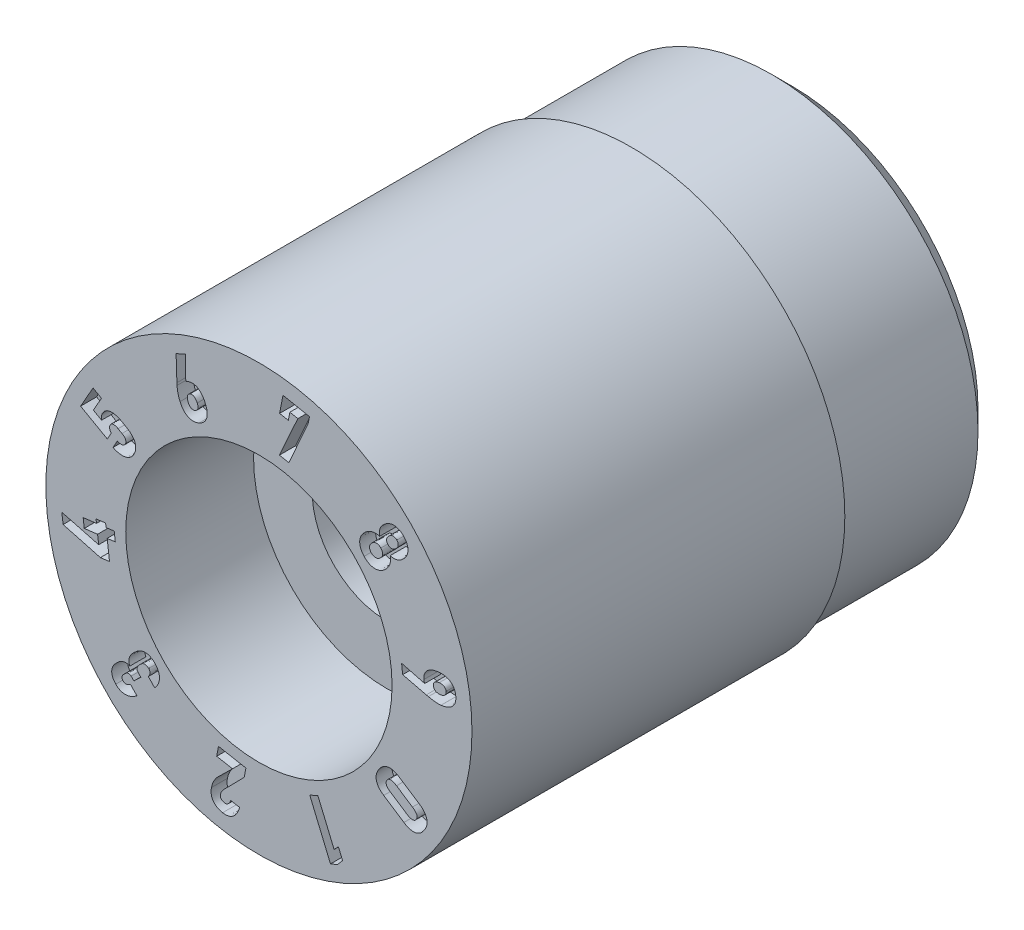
from build123d import *

# Parameters (mm, degrees)
SKETCH5_W          = 1.5
SKETCH5_H          = 1
CUT_EXTRUDE1_DEPTH = 0.15


with BuildPart() as part:
    # Sketch1 → Revolve1 (revolve)
    with BuildSketch(Plane(origin=(0, 0, 0), x_dir=(0, 0, -1), z_dir=(1, 0, 0)), mode=Mode.PRIVATE) as revolve1_sk:
        Polygon((0, 2), (0, 1.25), (1.2, 1.25), (1.2, 0.7), (5, 0.7), (5, 1.75), (4.75, 2), align=None)
    revolve(revolve1_sk.sketch.rotate(Axis((0, 0, 3.797909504), (0, 0, -1)), 90), axis=Axis((0, 0, 3.797909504), (0, 0, -1)))

    # Sketch5 → Cut-Revolve1 (revolve, cut)
    with BuildSketch(Plane(origin=(0, 0, 0), x_dir=(0, 0, -1), z_dir=(1, 0, 0)), mode=Mode.PRIVATE) as cut_revolve1_sk:
        with Locations((4.25, 2.435)):
            Rectangle(SKETCH5_W, SKETCH5_H)
    revolve(cut_revolve1_sk.sketch.rotate(Axis((0, 0, 0), (0, 0, -1)), 90), axis=Axis((0, 0, 0), (0, 0, -1)), mode=Mode.SUBTRACT)

    # Sketch7 → Cut-Extrude1 (cut)
    # profile 1 of 10: a face of its own
    with BuildSketch(Plane.XY):
        Polygon((0.474684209, 1.798838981), (0.462762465, 1.73749804), (0.281796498, 1.327063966), (0.192841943, 1.344386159), (0.365554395, 1.7276142), (0.290661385, 1.742185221), (0.276294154, 1.668209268), (0.194268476, 1.684206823), (0.2259579, 1.847239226), align=None)
    # profile 2 of 10: a face of its own
    with BuildSketch(Plane.XY):
        with BuildLine():
            Line((-0.740461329, 1.313243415), (-0.740359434, 1.312937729))
            add(Edge.make_bspline(
                [(-0.560208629, 1.229485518), (-0.571763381, 1.2241647), (-0.589587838, 1.218286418), (-0.61382565, 1.215481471), (-0.631073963, 1.216215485), (-0.647777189, 1.219448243), (-0.663698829, 1.225474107), (-0.678878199, 1.23399263), (-0.693304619, 1.244970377), (-0.706755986, 1.258514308), (-0.723784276, 1.280582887), (-0.734243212, 1.299464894), (-0.740359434, 1.312937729)],
                knots=[0, 0, 0, 0, 0.169424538, 0.247700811, 0.323760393, 0.398455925, 0.473317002, 0.549457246, 0.629523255, 0.713964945, 0.802912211, 1, 1, 1, 1], degree=3))
            add(Edge.make_bspline(
                [(-0.505287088, 1.421965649), (-0.49915535, 1.408359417), (-0.491382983, 1.387951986), (-0.48612773, 1.360295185), (-0.484601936, 1.341111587), (-0.485567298, 1.3228304), (-0.48902194, 1.305609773), (-0.494994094, 1.28950997), (-0.503423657, 1.274617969), (-0.514243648, 1.261061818), (-0.53226974, 1.24442119), (-0.548559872, 1.234827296), (-0.560208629, 1.229485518)],
                knots=[0, 0, 0, 0, 0.197487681, 0.286549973, 0.37114358, 0.451142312, 0.527616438, 0.602298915, 0.677047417, 0.752732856, 0.830522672, 1, 1, 1, 1], degree=3))
            Line((-0.505287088, 1.421965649), (-0.505388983, 1.422271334))
            add(Edge.make_bspline(
                [(-0.67219151, 1.509799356), (-0.661856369, 1.514610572), (-0.645732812, 1.519658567), (-0.623821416, 1.521453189), (-0.608101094, 1.520077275), (-0.592822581, 1.516294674), (-0.578054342, 1.509983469), (-0.563993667, 1.501063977), (-0.550658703, 1.489703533), (-0.537836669, 1.476226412), (-0.521601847, 1.454172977), (-0.511388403, 1.435563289), (-0.505388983, 1.422271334)],
                knots=[0, 0, 0, 0, 0.160458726, 0.235287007, 0.308247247, 0.381671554, 0.456024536, 0.533385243, 0.615194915, 0.702138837, 0.79472917, 1, 1, 1, 1], degree=3))
            add(Edge.make_bspline(
                [(-0.686243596, 1.501398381), (-0.681884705, 1.504702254), (-0.677169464, 1.507525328), (-0.67219151, 1.509799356)],
                knots=[0.764686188, 0.764686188, 0.764686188, 0.764686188, 1, 1, 1, 1], degree=3))
            Line((-0.686243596, 1.501398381), (-0.691347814, 1.723473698))
            Line((-0.691347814, 1.723473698), (-0.777143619, 1.684345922))
            Line((-0.777143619, 1.684345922), (-0.769909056, 1.451719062))
            add(Edge.make_bspline(
                [(-0.768584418, 1.430015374), (-0.768926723, 1.433644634), (-0.769680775, 1.440864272), (-0.769708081, 1.448122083), (-0.769909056, 1.451719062)],
                knots=[0, 0, 0, 0, 0.503063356, 1, 1, 1, 1], degree=3))
            add(Edge.make_bspline(
                [(-0.740461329, 1.313243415), (-0.744328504, 1.321719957), (-0.749611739, 1.334915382), (-0.755144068, 1.353319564), (-0.763192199, 1.383170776), (-0.766638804, 1.409125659), (-0.768584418, 1.430015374)],
                knots=[0, 0, 0, 0, 0.231657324, 0.352643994, 0.477573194, 1, 1, 1, 1], degree=3))
        make_face()
        with BuildLine():
            Line((-0.578957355, 1.382328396), (-0.578753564, 1.38202271))
            add(Edge.make_bspline(
                [(-0.597807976, 1.311918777), (-0.591682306, 1.31465331), (-0.583365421, 1.320235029), (-0.575624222, 1.330669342), (-0.572300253, 1.339484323), (-0.570731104, 1.349121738), (-0.571609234, 1.363829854), (-0.575451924, 1.374774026), (-0.578753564, 1.38202271)],
                knots=[0, 0, 0, 0, 0.244452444, 0.355993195, 0.467581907, 0.584057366, 0.709091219, 1, 1, 1, 1], degree=3))
            add(Edge.make_bspline(
                [(-0.662613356, 1.343506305), (-0.659337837, 1.336279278), (-0.653576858, 1.326212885), (-0.64305087, 1.316006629), (-0.6348762, 1.310712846), (-0.626053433, 1.30769299), (-0.613325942, 1.306594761), (-0.603773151, 1.309082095), (-0.597807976, 1.311918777)],
                knots=[0, 0, 0, 0, 0.292476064, 0.418585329, 0.535161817, 0.647146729, 0.757326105, 1, 1, 1, 1], degree=3))
            Line((-0.662613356, 1.343506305), (-0.662715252, 1.343811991))
            add(Edge.make_bspline(
                [(-0.64773665, 1.421456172), (-0.653766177, 1.418775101), (-0.662202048, 1.41296223), (-0.668932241, 1.401502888), (-0.671900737, 1.391812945), (-0.672759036, 1.380982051), (-0.67080472, 1.364454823), (-0.666539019, 1.352058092), (-0.662715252, 1.343811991)],
                knots=[0, 0, 0, 0, 0.223938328, 0.330652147, 0.442080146, 0.562622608, 0.693739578, 1, 1, 1, 1], degree=3))
            add(Edge.make_bspline(
                [(-0.578957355, 1.382328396), (-0.58271389, 1.390669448), (-0.589222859, 1.402101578), (-0.600477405, 1.414393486), (-0.609209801, 1.420720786), (-0.618451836, 1.424792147), (-0.631671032, 1.426761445), (-0.641654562, 1.424428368), (-0.64773665, 1.421456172)],
                knots=[0, 0, 0, 0, 0.307386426, 0.437241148, 0.556520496, 0.666849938, 0.77294532, 1, 1, 1, 1], degree=3))
        make_face(mode=Mode.SUBTRACT)
    # profile 3 of 10: a face of its own
    with BuildSketch(Plane.XY):
        with BuildLine():
            Line((-1.369282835, 0.625845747), (-1.368977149, 0.625641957))
            add(Edge.make_bspline(
                [(-1.175070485, 0.664565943), (-1.180651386, 0.654688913), (-1.19082486, 0.640990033), (-1.207871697, 0.626351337), (-1.221856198, 0.617309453), (-1.237192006, 0.610462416), (-1.25361801, 0.60573298), (-1.271143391, 0.603357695), (-1.289585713, 0.603044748), (-1.308805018, 0.605149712), (-1.335932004, 0.611266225), (-1.355852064, 0.619229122), (-1.368977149, 0.625641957)],
                knots=[0, 0, 0, 0, 0.154778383, 0.229982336, 0.305397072, 0.381063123, 0.458169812, 0.537687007, 0.621529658, 0.709094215, 0.800674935, 1, 1, 1, 1], degree=3))
            add(Edge.make_bspline(
                [(-1.244461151, 0.85347974), (-1.231374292, 0.846040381), (-1.213000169, 0.833936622), (-1.19225839, 0.814580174), (-1.179747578, 0.7997833), (-1.169715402, 0.784340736), (-1.162422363, 0.768289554), (-1.157557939, 0.751766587), (-1.155681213, 0.73471278), (-1.156413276, 0.717331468), (-1.161134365, 0.693159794), (-1.16877107, 0.675772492), (-1.175070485, 0.664565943)],
                knots=[0, 0, 0, 0, 0.19806082, 0.28743423, 0.372024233, 0.452139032, 0.528649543, 0.602965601, 0.677550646, 0.753055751, 0.830797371, 1, 1, 1, 1], degree=3))
            Line((-1.244461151, 0.85347974), (-1.280939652, 0.874164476))
            add(Edge.make_bspline(
                [(-1.467713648, 0.854906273), (-1.46255547, 0.864339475), (-1.452857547, 0.877018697), (-1.436688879, 0.890223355), (-1.423401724, 0.897602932), (-1.408873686, 0.902756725), (-1.393205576, 0.905449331), (-1.376546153, 0.905897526), (-1.358914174, 0.904122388), (-1.340446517, 0.899891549), (-1.313665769, 0.891278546), (-1.294078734, 0.8814588), (-1.280939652, 0.874164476)],
                knots=[0, 0, 0, 0, 0.15216642, 0.223346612, 0.294447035, 0.366447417, 0.440746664, 0.518750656, 0.601933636, 0.691146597, 0.786728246, 1, 1, 1, 1], degree=3))
            add(Edge.make_bspline(
                [(-1.476782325, 0.793463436), (-1.478340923, 0.798034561), (-1.479463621, 0.805390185), (-1.479473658, 0.815599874), (-1.47852254, 0.823821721), (-1.476826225, 0.832101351), (-1.473684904, 0.842700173), (-1.470490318, 0.850252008), (-1.467713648, 0.854906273)],
                knots=[0, 0, 0, 0, 0.226423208, 0.347978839, 0.479918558, 0.615426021, 0.745491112, 1, 1, 1, 1], degree=3))
            Line((-1.476782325, 0.793463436), (-1.55371324, 0.836972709))
            Line((-1.55371324, 0.836972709), (-1.477903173, 0.970964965))
            Line((-1.477903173, 0.970964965), (-1.556871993, 1.015595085))
            Line((-1.556871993, 1.015595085), (-1.673643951, 0.809155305))
            Line((-1.673643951, 0.809155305), (-1.423389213, 0.6676228))
            Line((-1.423389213, 0.6676228), (-1.385178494, 0.735281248))
            add(Edge.make_bspline(
                [(-1.395673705, 0.796316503), (-1.398355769, 0.791427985), (-1.401610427, 0.783629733), (-1.402501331, 0.772678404), (-1.401921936, 0.764646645), (-1.399856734, 0.756738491), (-1.395020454, 0.746314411), (-1.389424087, 0.739457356), (-1.385178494, 0.735281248)],
                knots=[0, 0, 0, 0, 0.250775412, 0.369741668, 0.488581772, 0.609434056, 0.733145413, 1, 1, 1, 1], degree=3))
            add(Edge.make_bspline(
                [(-1.321901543, 0.801716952), (-1.329528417, 0.806090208), (-1.340943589, 0.811440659), (-1.356496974, 0.814852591), (-1.366639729, 0.815110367), (-1.375844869, 0.813463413), (-1.386683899, 0.808313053), (-1.392870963, 0.801603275), (-1.395673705, 0.796316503)],
                knots=[0, 0, 0, 0, 0.317819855, 0.450521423, 0.571898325, 0.681761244, 0.784843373, 1, 1, 1, 1], degree=3))
            Line((-1.321901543, 0.801716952), (-1.285423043, 0.781032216))
            add(Edge.make_bspline(
                [(-1.254039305, 0.710724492), (-1.250829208, 0.716462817), (-1.247335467, 0.72597478), (-1.248302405, 0.73902214), (-1.251235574, 0.748413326), (-1.256616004, 0.75741654), (-1.267121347, 0.769636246), (-1.277848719, 0.776616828), (-1.285423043, 0.781032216)],
                knots=[0, 0, 0, 0, 0.229073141, 0.335997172, 0.446505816, 0.565755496, 0.695468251, 1, 1, 1, 1], degree=3))
            add(Edge.make_bspline(
                [(-1.328015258, 0.698089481), (-1.32043139, 0.694668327), (-1.309035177, 0.690615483), (-1.293731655, 0.688924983), (-1.283528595, 0.689577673), (-1.274244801, 0.692102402), (-1.263169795, 0.697968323), (-1.257062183, 0.705316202), (-1.254039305, 0.710724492)],
                knots=[0, 0, 0, 0, 0.300684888, 0.43118925, 0.55272704, 0.667113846, 0.7755996, 1, 1, 1, 1], degree=3))
            Line((-1.328015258, 0.698089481), (-1.328320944, 0.698293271))
            Line((-1.328320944, 0.698293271), (-1.369282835, 0.625845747))
        make_face()
    # profile 4 of 10: a face of its own
    with BuildSketch(Plane.XY):
        Polygon((-1.524583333, -0.069292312), (-1.528883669, -0.034854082), (-1.439012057, -0.023645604), (-1.434712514, -0.058113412), (-1.358311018, -0.048609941), (-1.348019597, -0.131552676), (-1.424367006, -0.141049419), (-1.402227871, -0.318530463), (-1.488023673, -0.329229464), (-1.838135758, -0.235180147), (-1.849751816, -0.141436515), (-1.504225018, -0.23232708), (-1.514227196, -0.152226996), (-1.639643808, -0.167827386), (-1.649935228, -0.084884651), align=None)
    # profile 5 of 10: a face of its own
    with BuildSketch(Plane.XY):
        with BuildLine():
            add(Edge.make_bspline(
                [(-1.163926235, -0.935231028), (-1.154002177, -0.92604651), (-1.138799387, -0.913306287), (-1.116326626, -0.901097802), (-1.100003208, -0.89456321), (-1.083558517, -0.890612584), (-1.067203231, -0.889287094), (-1.050927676, -0.890368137), (-1.034863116, -0.894238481), (-1.019091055, -0.900550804), (-0.997846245, -0.912378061), (-0.983926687, -0.925034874), (-0.975012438, -0.93411018)],
                knots=[0, 0, 0, 0, 0.189438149, 0.274812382, 0.356421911, 0.434469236, 0.510181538, 0.584875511, 0.661428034, 0.740040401, 0.821631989, 1, 1, 1, 1], degree=3))
            add(Edge.make_bspline(
                [(-0.975012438, -0.93411018), (-0.966406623, -0.943428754), (-0.954558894, -0.958163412), (-0.943429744, -0.980227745), (-0.937464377, -0.996966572), (-0.933894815, -1.014103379), (-0.932542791, -1.031463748), (-0.934145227, -1.048976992), (-0.937853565, -1.066550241), (-0.944253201, -1.083964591), (-0.956535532, -1.107219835), (-0.969109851, -1.123082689), (-0.978680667, -1.132907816)],
                knots=[0, 0, 0, 0, 0.171379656, 0.252459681, 0.332099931, 0.410217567, 0.487784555, 0.565878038, 0.646425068, 0.729269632, 0.815073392, 1, 1, 1, 1], degree=3))
            Line((-0.978680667, -1.132907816), (-1.037881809, -1.070751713))
            add(Edge.make_bspline(
                [(-1.037881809, -1.070751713), (-1.031883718, -1.063757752), (-1.026065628, -1.05374623), (-1.022886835, -1.040898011), (-1.022254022, -1.03503418), (-1.022476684, -1.029311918), (-1.023389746, -1.023760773), (-1.025045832, -1.018371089), (-1.02835074, -1.011303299), (-1.032113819, -1.006637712), (-1.034824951, -1.003704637)],
                knots=[0, 0, 0, 0, 0.373226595, 0.45514242, 0.53383078, 0.610762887, 0.685922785, 0.760617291, 0.838001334, 1, 1, 1, 1], degree=3))
            add(Edge.make_bspline(
                [(-1.034824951, -1.003704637), (-1.039728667, -0.998628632), (-1.048012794, -0.991841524), (-1.061155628, -0.987865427), (-1.071007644, -0.987124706), (-1.081039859, -0.988708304), (-1.09502546, -0.994263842), (-1.104405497, -1.001428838), (-1.110227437, -1.00706718)],
                knots=[0, 0, 0, 0, 0.249603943, 0.362893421, 0.476239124, 0.593030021, 0.715449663, 1, 1, 1, 1], degree=3))
            Line((-1.110227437, -1.00706718), (-1.118684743, -1.015116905))
            add(Edge.make_bspline(
                [(-1.118684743, -1.015116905), (-1.124631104, -1.02106653), (-1.133115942, -1.029896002), (-1.14037664, -1.043407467), (-1.143661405, -1.052685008), (-1.144520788, -1.061746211), (-1.142744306, -1.073446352), (-1.137788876, -1.081058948), (-1.13376524, -1.085322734)],
                knots=[0, 0, 0, 0, 0.313958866, 0.446943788, 0.566426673, 0.676461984, 0.781027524, 1, 1, 1, 1], degree=3))
            Line((-1.13376524, -1.085322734), (-1.108087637, -1.112324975))
            Line((-1.108087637, -1.112324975), (-1.173708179, -1.174786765))
            Line((-1.173708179, -1.174786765), (-1.199385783, -1.147784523))
            add(Edge.make_bspline(
                [(-1.199385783, -1.147784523), (-1.202694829, -1.144289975), (-1.208883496, -1.139967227), (-1.218655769, -1.13852041), (-1.226337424, -1.139200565), (-1.23443772, -1.141635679), (-1.246083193, -1.147740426), (-1.254196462, -1.154258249), (-1.259402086, -1.159298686)],
                knots=[0, 0, 0, 0, 0.21247136, 0.314900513, 0.426780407, 0.547702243, 0.682698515, 1, 1, 1, 1], degree=3))
            Line((-1.259402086, -1.159298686), (-1.265617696, -1.165208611))
            add(Edge.make_bspline(
                [(-1.265617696, -1.165208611), (-1.270582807, -1.169855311), (-1.277088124, -1.177279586), (-1.282707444, -1.188453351), (-1.284949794, -1.196381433), (-1.285286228, -1.204131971), (-1.283271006, -1.214294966), (-1.278910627, -1.220975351), (-1.27519585, -1.224715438)],
                knots=[0, 0, 0, 0, 0.30029639, 0.428754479, 0.548155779, 0.660447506, 0.767243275, 1, 1, 1, 1], degree=3))
            add(Edge.make_bspline(
                [(-1.27519585, -1.224715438), (-1.272692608, -1.227327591), (-1.268371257, -1.230703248), (-1.261749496, -1.233719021), (-1.256401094, -1.235275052), (-1.250658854, -1.235967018), (-1.244633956, -1.235826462), (-1.23835456, -1.234980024), (-1.231820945, -1.233459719), (-1.225070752, -1.23107656), (-1.215588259, -1.226701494), (-1.208661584, -1.222536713), (-1.204174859, -1.21931499)],
                knots=[0, 0, 0, 0, 0.139542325, 0.208718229, 0.279621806, 0.353559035, 0.430866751, 0.511467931, 0.59758725, 0.68915462, 0.787063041, 1, 1, 1, 1], degree=3))
            Line((-1.204174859, -1.21931499), (-1.145075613, -1.281267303))
            add(Edge.make_bspline(
                [(-1.145075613, -1.281267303), (-1.156221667, -1.290341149), (-1.173674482, -1.302353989), (-1.198575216, -1.313987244), (-1.216740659, -1.320206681), (-1.234761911, -1.323848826), (-1.252387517, -1.325409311), (-1.269578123, -1.3243624), (-1.286176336, -1.320987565), (-1.30204992, -1.315347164), (-1.322252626, -1.30484859), (-1.335519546, -1.293764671), (-1.343465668, -1.285445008)],
                knots=[0, 0, 0, 0, 0.1959913, 0.286892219, 0.373831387, 0.456977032, 0.536847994, 0.614279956, 0.69079912, 0.766921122, 0.843102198, 1, 1, 1, 1], degree=3))
            add(Edge.make_bspline(
                [(-1.343465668, -1.285445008), (-1.349737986, -1.278661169), (-1.358542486, -1.268310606), (-1.367796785, -1.253297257), (-1.373279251, -1.242228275), (-1.377370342, -1.230982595), (-1.380154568, -1.219605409), (-1.381595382, -1.208116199), (-1.381684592, -1.196561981), (-1.380486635, -1.184956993), (-1.377763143, -1.17346904), (-1.373909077, -1.162020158), (-1.368496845, -1.150825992), (-1.36197458, -1.139619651), (-1.350963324, -1.124552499), (-1.341198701, -1.114000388), (-1.334091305, -1.107230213)],
                knots=[0, 0, 0, 0, 0.1366971, 0.199784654, 0.260155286, 0.318891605, 0.376217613, 0.432858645, 0.489566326, 0.546590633, 0.604777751, 0.663653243, 0.724710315, 0.78814022, 0.854993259, 1, 1, 1, 1], degree=3))
            Line((-1.334091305, -1.107230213), (-1.323188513, -1.096836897))
            add(Edge.make_bspline(
                [(-1.323188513, -1.096836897), (-1.315320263, -1.089272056), (-1.302441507, -1.079470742), (-1.283368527, -1.070446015), (-1.26892273, -1.06601774), (-1.254216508, -1.063844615), (-1.234348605, -1.064102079), (-1.219823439, -1.068014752), (-1.21059426, -1.071770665)],
                knots=[0, 0, 0, 0, 0.26755636, 0.392657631, 0.515349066, 0.636469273, 0.755501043, 1, 1, 1, 1], degree=3))
            add(Edge.make_bspline(
                [(-1.21059426, -1.071770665), (-1.213363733, -1.067168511), (-1.216337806, -1.05980075), (-1.219213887, -1.049685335), (-1.220374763, -1.041987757), (-1.220966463, -1.034174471), (-1.22045936, -1.026224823), (-1.219380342, -1.018167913), (-1.216714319, -1.007118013), (-1.211375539, -0.993186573), (-1.19834025, -0.970563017), (-1.185072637, -0.955139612), (-1.174829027, -0.945624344)],
                knots=[0, 0, 0, 0, 0.113125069, 0.167511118, 0.2220867, 0.27753044, 0.33293226, 0.390244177, 0.449325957, 0.573035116, 0.704314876, 1, 1, 1, 1], degree=3))
            Line((-1.174829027, -0.945624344), (-1.163926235, -0.935231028))
        make_face()
    # profile 6 of 10: a face of its own
    with BuildSketch(Plane.XY):
        Polygon((0.671920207, -1.739456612), (0.477300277, -1.276444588), (0.554129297, -1.244143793), (0.705647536, -1.604649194), (0.746201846, -1.562464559), (0.785125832, -1.655189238), (0.73754075, -1.711944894), align=None)
    # profile 7 of 10: a face of its own
    with BuildSketch(Plane.XY):
        with BuildLine():
            Line((-0.328167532, -1.633726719), (-0.137725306, -1.440023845))
            Line((-0.137725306, -1.440023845), (-0.122237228, -1.356673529))
            Line((-0.122237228, -1.356673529), (-0.379726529, -1.308986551))
            Line((-0.379726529, -1.308986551), (-0.39623356, -1.398144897))
            Line((-0.39623356, -1.398144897), (-0.247466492, -1.425656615))
            Line((-0.247466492, -1.425656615), (-0.382885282, -1.558426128))
            add(Edge.make_bspline(
                [(-0.445448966, -1.676930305), (-0.443353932, -1.665796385), (-0.438962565, -1.649251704), (-0.43054587, -1.6280013), (-0.423018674, -1.61243752), (-0.414396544, -1.597523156), (-0.40172269, -1.578908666), (-0.39081822, -1.566147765), (-0.382885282, -1.558426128)],
                knots=[0, 0, 0, 0, 0.249882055, 0.376348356, 0.503681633, 0.630902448, 0.756000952, 1, 1, 1, 1], degree=3))
            Line((-0.445448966, -1.676930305), (-0.445550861, -1.677337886))
            add(Edge.make_bspline(
                [(-0.340496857, -1.829059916), (-0.353172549, -1.826812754), (-0.371293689, -1.821553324), (-0.393332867, -1.811021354), (-0.407433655, -1.801576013), (-0.419546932, -1.790619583), (-0.429703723, -1.778251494), (-0.437723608, -1.76441353), (-0.443657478, -1.749223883), (-0.447362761, -1.73277191), (-0.449782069, -1.708613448), (-0.447802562, -1.689908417), (-0.445550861, -1.677337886)],
                knots=[0, 0, 0, 0, 0.18399187, 0.268294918, 0.348466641, 0.425852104, 0.501120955, 0.576446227, 0.653671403, 0.733453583, 0.816937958, 1, 1, 1, 1], degree=3))
            add(Edge.make_bspline(
                [(-0.181540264, -1.706683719), (-0.185155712, -1.720884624), (-0.191836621, -1.741298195), (-0.204611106, -1.766058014), (-0.21540014, -1.782044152), (-0.227388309, -1.79608419), (-0.24083493, -1.807633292), (-0.255154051, -1.81734097), (-0.270747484, -1.824436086), (-0.287181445, -1.829276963), (-0.310565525, -1.832587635), (-0.328575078, -1.831364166), (-0.340496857, -1.829059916)],
                knots=[0, 0, 0, 0, 0.196340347, 0.286033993, 0.372174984, 0.454051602, 0.532377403, 0.608805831, 0.68490211, 0.760732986, 0.837453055, 1, 1, 1, 1], degree=3))
            Line((-0.181540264, -1.706683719), (-0.181540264, -1.706378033))
            Line((-0.181540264, -1.706378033), (-0.265705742, -1.690788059))
            Line((-0.265705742, -1.690788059), (-0.265705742, -1.691093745))
            add(Edge.make_bspline(
                [(-0.324601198, -1.739901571), (-0.318320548, -1.740954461), (-0.308527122, -1.741214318), (-0.296599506, -1.736584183), (-0.288558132, -1.731138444), (-0.281248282, -1.723781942), (-0.272474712, -1.710764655), (-0.268020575, -1.699261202), (-0.265705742, -1.691093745)],
                knots=[0, 0, 0, 0, 0.226995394, 0.334959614, 0.447554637, 0.568154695, 0.699419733, 1, 1, 1, 1], degree=3))
            add(Edge.make_bspline(
                [(-0.360672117, -1.690278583), (-0.361750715, -1.696248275), (-0.362310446, -1.705253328), (-0.359130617, -1.71633186), (-0.355246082, -1.723429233), (-0.349533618, -1.729258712), (-0.339842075, -1.736151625), (-0.330747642, -1.738548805), (-0.324601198, -1.739901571)],
                knots=[0, 0, 0, 0, 0.262584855, 0.378171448, 0.491971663, 0.606677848, 0.726239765, 1, 1, 1, 1], degree=3))
            Line((-0.360672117, -1.690278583), (-0.360570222, -1.689667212))
            add(Edge.make_bspline(
                [(-0.328167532, -1.633726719), (-0.336407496, -1.642025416), (-0.350061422, -1.659322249), (-0.358580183, -1.679685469), (-0.360570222, -1.689667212)],
                knots=[0, 0, 0, 0, 0.535832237, 1, 1, 1, 1], degree=3))
        make_face()
    # profile 8 of 10: a face of its own
    with BuildSketch(Plane.XY):
        with BuildLine():
            add(Edge.make_bspline(
                [(1.171599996, -0.932550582), (1.162796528, -0.926623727), (1.150222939, -0.917419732), (1.135628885, -0.903391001), (1.126321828, -0.892813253), (1.118389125, -0.881831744), (1.111856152, -0.870487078), (1.106565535, -0.858808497), (1.102803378, -0.846726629), (1.100415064, -0.834387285), (1.099648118, -0.82183167), (1.100190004, -0.809094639), (1.102581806, -0.796253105), (1.10607321, -0.783190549), (1.113417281, -0.765262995), (1.120608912, -0.752219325), (1.126256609, -0.74373868)],
                knots=[0, 0, 0, 0, 0.144105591, 0.210579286, 0.274249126, 0.33498581, 0.394019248, 0.451559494, 0.508536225, 0.565283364, 0.62161375, 0.678811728, 0.737742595, 0.798437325, 0.861920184, 1, 1, 1, 1], degree=3))
            add(Edge.make_bspline(
                [(1.126256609, -0.74373868), (1.131892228, -0.735186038), (1.140992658, -0.723232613), (1.15488618, -0.709579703), (1.16542043, -0.701066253), (1.176365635, -0.693918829), (1.187864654, -0.688416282), (1.199789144, -0.684276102), (1.212145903, -0.681649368), (1.22479535, -0.680417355), (1.237637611, -0.68066952), (1.250653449, -0.682183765), (1.263809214, -0.685201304), (1.277149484, -0.689508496), (1.29559001, -0.697390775), (1.308936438, -0.705146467), (1.317717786, -0.710928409)],
                knots=[0, 0, 0, 0, 0.139030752, 0.202899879, 0.263856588, 0.322526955, 0.379823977, 0.436367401, 0.493398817, 0.550806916, 0.608416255, 0.667346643, 0.728275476, 0.791230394, 0.85730565, 1, 1, 1, 1], degree=3))
            Line((1.317717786, -0.710928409), (1.507141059, -0.835750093))
            add(Edge.make_bspline(
                [(1.507141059, -0.835750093), (1.515947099, -0.841674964), (1.528513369, -0.850884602), (1.543118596, -0.86490472), (1.552409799, -0.875519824), (1.560454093, -0.886440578), (1.567035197, -0.897812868), (1.572127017, -0.909596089), (1.57594918, -0.92167102), (1.578322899, -0.934016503), (1.579093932, -0.946570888), (1.578551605, -0.959273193), (1.576168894, -0.972130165), (1.572523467, -0.985138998), (1.565453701, -1.003222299), (1.557893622, -1.016104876), (1.552382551, -1.024663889)],
                knots=[0, 0, 0, 0, 0.144010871, 0.210440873, 0.274068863, 0.335035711, 0.394030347, 0.451768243, 0.508707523, 0.565417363, 0.621710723, 0.678871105, 0.737309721, 0.798531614, 0.861803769, 1, 1, 1, 1], degree=3))
            add(Edge.make_bspline(
                [(1.552382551, -1.024663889), (1.546718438, -1.03316667), (1.537733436, -1.045149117), (1.523958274, -1.058819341), (1.513487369, -1.067362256), (1.502600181, -1.074543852), (1.491213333, -1.080221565), (1.479343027, -1.08428649), (1.4671212, -1.087107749), (1.454556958, -1.088235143), (1.44177381, -1.088214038), (1.428811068, -1.086470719), (1.415595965, -1.083530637), (1.402176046, -1.079067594), (1.383495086, -1.071076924), (1.369899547, -1.063293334), (1.361023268, -1.057372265)],
                knots=[0, 0, 0, 0, 0.138584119, 0.202056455, 0.262589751, 0.32144765, 0.378471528, 0.434519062, 0.491138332, 0.548026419, 0.605107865, 0.664030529, 0.72489372, 0.788361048, 0.855392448, 1, 1, 1, 1], degree=3))
            Line((1.361023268, -1.057372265), (1.171599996, -0.932550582))
        make_face()
        with BuildLine():
            add(Edge.make_bspline(
                [(1.291734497, -0.793973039), (1.282771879, -0.788031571), (1.269430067, -0.780368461), (1.251017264, -0.774444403), (1.240724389, -0.773085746), (1.233080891, -0.773154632), (1.227762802, -0.773971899), (1.222706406, -0.7754968), (1.217985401, -0.777814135), (1.213452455, -0.780650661), (1.207679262, -0.785625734), (1.204089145, -0.790263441), (1.201862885, -0.793565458)],
                knots=[0, 0, 0, 0, 0.317397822, 0.449370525, 0.567395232, 0.621435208, 0.674076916, 0.725350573, 0.776369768, 0.828553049, 0.882491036, 1, 1, 1, 1], degree=3))
            add(Edge.make_bspline(
                [(1.201862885, -0.793565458), (1.197508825, -0.799751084), (1.193403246, -0.81036899), (1.193700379, -0.825222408), (1.197365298, -0.835847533), (1.203687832, -0.846251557), (1.216438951, -0.860759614), (1.228719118, -0.869995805), (1.237628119, -0.875998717)],
                knots=[0, 0, 0, 0, 0.222583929, 0.324870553, 0.432330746, 0.550087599, 0.682294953, 1, 1, 1, 1], degree=3))
            Line((1.237628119, -0.875998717), (1.387006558, -0.97442953))
            add(Edge.make_bspline(
                [(1.387006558, -0.97442953), (1.395891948, -0.980505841), (1.40938238, -0.987833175), (1.427669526, -0.993945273), (1.437986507, -0.995400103), (1.445624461, -0.995118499), (1.450978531, -0.994337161), (1.45603459, -0.992801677), (1.460755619, -0.990487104), (1.465288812, -0.98765), (1.471024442, -0.982705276), (1.474599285, -0.978117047), (1.476776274, -0.974837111)],
                knots=[0, 0, 0, 0, 0.317448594, 0.449917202, 0.567123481, 0.622272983, 0.674992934, 0.7263428, 0.777437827, 0.829698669, 0.883716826, 1, 1, 1, 1], degree=3))
            add(Edge.make_bspline(
                [(1.476776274, -0.974837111), (1.480939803, -0.968568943), (1.485474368, -0.95797904), (1.484905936, -0.943108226), (1.481265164, -0.932527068), (1.474944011, -0.92218402), (1.462352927, -0.907572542), (1.449980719, -0.898441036), (1.441112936, -0.892403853)],
                knots=[0, 0, 0, 0, 0.223805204, 0.326172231, 0.432727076, 0.5505369, 0.682152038, 1, 1, 1, 1], degree=3))
            Line((1.441112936, -0.892403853), (1.291734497, -0.793973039))
        make_face(mode=Mode.SUBTRACT)
    # profile 9 of 10: a face of its own
    with BuildSketch(Plane.XY):
        with BuildLine():
            Line((1.680950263, 0.327088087), (1.680644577, 0.327088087))
            add(Edge.make_bspline(
                [(1.548486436, 0.198394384), (1.54727652, 0.20894883), (1.547561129, 0.224891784), (1.552999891, 0.24513791), (1.55939042, 0.25929071), (1.567960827, 0.272473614), (1.578762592, 0.284409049), (1.59149407, 0.29513956), (1.606163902, 0.304608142), (1.622555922, 0.312743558), (1.647234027, 0.321631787), (1.667044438, 0.325438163), (1.680644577, 0.327088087)],
                knots=[0, 0, 0, 0, 0.154341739, 0.228385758, 0.302989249, 0.37889976, 0.455725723, 0.535850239, 0.619967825, 0.70862168, 0.800971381, 1, 1, 1, 1], degree=3))
            add(Edge.make_bspline(
                [(1.55643399, 0.169589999), (1.55626082, 0.169951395), (1.554810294, 0.173054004), (1.551295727, 0.182434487), (1.549115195, 0.191828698), (1.548486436, 0.198394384)],
                knots=[0.575687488, 0.575687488, 0.575687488, 0.575687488, 0.592673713, 0.720867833, 1, 1, 1, 1], degree=3))
            Line((1.55643399, 0.169589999), (1.339091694, 0.225906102))
            Line((1.339091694, 0.225906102), (1.349383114, 0.13817429))
            Line((1.349383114, 0.13817429), (1.570903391, 0.084577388))
            add(Edge.make_bspline(
                [(1.590365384, 0.079992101), (1.58706659, 0.080680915), (1.580524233, 0.081985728), (1.574106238, 0.083804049), (1.570903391, 0.084577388)],
                knots=[0, 0, 0, 0, 0.505692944, 1, 1, 1, 1], degree=3))
            add(Edge.make_bspline(
                [(1.709073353, 0.06949689), (1.700453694, 0.068371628), (1.687115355, 0.067920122), (1.668939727, 0.068226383), (1.654431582, 0.069445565), (1.639342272, 0.071167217), (1.617852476, 0.074401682), (1.601499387, 0.077653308), (1.590365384, 0.079992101)],
                knots=[0, 0, 0, 0, 0.217525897, 0.33418394, 0.455432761, 0.582255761, 0.714812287, 1, 1, 1, 1], degree=3))
            Line((1.709073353, 0.06949689), (1.709379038, 0.06949689))
            add(Edge.make_bspline(
                [(1.847650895, 0.216022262), (1.849294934, 0.203388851), (1.849313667, 0.184576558), (1.844374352, 0.160618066), (1.838198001, 0.144360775), (1.829689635, 0.129456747), (1.818809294, 0.116015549), (1.805630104, 0.104165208), (1.790277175, 0.093836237), (1.772888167, 0.085079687), (1.746073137, 0.075446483), (1.724413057, 0.071190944), (1.709379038, 0.06949689)],
                knots=[0, 0, 0, 0, 0.167209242, 0.24472505, 0.320117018, 0.394646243, 0.469190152, 0.546247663, 0.626545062, 0.711530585, 0.801283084, 1, 1, 1, 1], degree=3))
            add(Edge.make_bspline(
                [(1.680950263, 0.327088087), (1.695836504, 0.328892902), (1.717744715, 0.32990525), (1.745835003, 0.326651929), (1.764610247, 0.322043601), (1.781741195, 0.315564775), (1.797147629, 0.3071037), (1.810555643, 0.296410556), (1.82216634, 0.283897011), (1.831837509, 0.269510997), (1.842043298, 0.247199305), (1.846281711, 0.228789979), (1.847650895, 0.216022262)],
                knots=[0, 0, 0, 0, 0.19791642, 0.287724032, 0.372159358, 0.452289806, 0.528707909, 0.603020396, 0.677527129, 0.753081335, 0.830657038, 1, 1, 1, 1], degree=3))
        make_face()
        with BuildLine():
            Line((1.704182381, 0.152847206), (1.7037748, 0.152847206))
            add(Edge.make_bspline(
                [(1.637746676, 0.191363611), (1.638607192, 0.18486421), (1.641332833, 0.175122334), (1.649686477, 0.165057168), (1.657501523, 0.159107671), (1.667089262, 0.154984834), (1.682598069, 0.151446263), (1.695183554, 0.151938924), (1.7037748, 0.152847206)],
                knots=[0, 0, 0, 0, 0.230168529, 0.338417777, 0.44964619, 0.568573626, 0.698315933, 1, 1, 1, 1], degree=3))
            add(Edge.make_bspline(
                [(1.692668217, 0.244552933), (1.684077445, 0.243532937), (1.671796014, 0.241026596), (1.657561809, 0.234005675), (1.649363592, 0.227629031), (1.643090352, 0.220116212), (1.637381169, 0.208211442), (1.637055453, 0.198014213), (1.637746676, 0.191363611)],
                knots=[0, 0, 0, 0, 0.301058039, 0.429120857, 0.547462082, 0.658814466, 0.765816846, 1, 1, 1, 1], degree=3))
            Line((1.692668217, 0.244552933), (1.692973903, 0.244552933))
            add(Edge.make_bspline(
                [(1.757066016, 0.205425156), (1.756339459, 0.212092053), (1.753580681, 0.221854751), (1.745454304, 0.232180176), (1.737732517, 0.238002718), (1.728514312, 0.242343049), (1.713458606, 0.245792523), (1.70131084, 0.24558825), (1.692973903, 0.244552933)],
                knots=[0, 0, 0, 0, 0.237916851, 0.346299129, 0.458254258, 0.576207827, 0.703244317, 1, 1, 1, 1], degree=3))
            add(Edge.make_bspline(
                [(1.704182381, 0.152847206), (1.712501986, 0.153818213), (1.724294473, 0.156488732), (1.738085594, 0.163281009), (1.745959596, 0.169610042), (1.7521218, 0.177020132), (1.757265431, 0.188947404), (1.758047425, 0.198850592), (1.757066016, 0.205425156)],
                knots=[0, 0, 0, 0, 0.298041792, 0.425532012, 0.543245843, 0.654923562, 0.764690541, 1, 1, 1, 1], degree=3))
        make_face(mode=Mode.SUBTRACT)
    # profile 10 of 10: a face of its own
    with BuildSketch(Plane.XY):
        with BuildLine():
            add(Edge.make_bspline(
                [(1.184761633, 0.910677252), (1.175228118, 0.901711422), (1.15971232, 0.890066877), (1.136961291, 0.87896663), (1.119758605, 0.873301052), (1.102319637, 0.870221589), (1.084823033, 0.869732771), (1.067399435, 0.871618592), (1.050203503, 0.876316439), (1.03344718, 0.883370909), (1.011415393, 0.896338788), (0.99674772, 0.909350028), (0.987696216, 0.919032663)],
                knots=[0, 0, 0, 0, 0.17663491, 0.259674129, 0.3407139, 0.420303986, 0.497813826, 0.576233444, 0.655965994, 0.737533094, 0.820954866, 1, 1, 1, 1], degree=3))
            add(Edge.make_bspline(
                [(0.987696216, 0.919032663), (0.978843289, 0.928835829), (0.96666525, 0.944244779), (0.955507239, 0.967263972), (0.949628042, 0.984498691), (0.946286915, 1.002000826), (0.94575958, 1.019470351), (0.947421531, 1.036852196), (0.951902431, 1.053988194), (0.958758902, 1.070739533), (0.971344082, 1.092710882), (0.984298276, 1.107160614), (0.993809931, 1.116098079)],
                knots=[0, 0, 0, 0, 0.178864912, 0.262560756, 0.344367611, 0.424163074, 0.502186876, 0.579638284, 0.659180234, 0.740438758, 0.82344426, 1, 1, 1, 1], degree=3))
            Line((0.993809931, 1.116098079), (0.999923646, 1.121804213))
            add(Edge.make_bspline(
                [(0.999923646, 1.121804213), (1.008872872, 1.130158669), (1.023831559, 1.140995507), (1.046193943, 1.151134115), (1.063731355, 1.156706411), (1.081678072, 1.159974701), (1.105219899, 1.161115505), (1.122578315, 1.158289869), (1.133508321, 1.154614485)],
                knots=[0, 0, 0, 0, 0.255100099, 0.381156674, 0.510316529, 0.637624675, 0.76020164, 1, 1, 1, 1], degree=3))
            add(Edge.make_bspline(
                [(1.133508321, 1.154614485), (1.131082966, 1.164110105), (1.129395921, 1.178895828), (1.131408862, 1.198645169), (1.13471175, 1.213422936), (1.139999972, 1.227689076), (1.149242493, 1.245494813), (1.158821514, 1.257119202), (1.166114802, 1.263846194)],
                knots=[0, 0, 0, 0, 0.246184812, 0.369649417, 0.49738432, 0.625631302, 0.75082965, 1, 1, 1, 1], degree=3))
            Line((1.166114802, 1.263846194), (1.175692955, 1.272711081))
            add(Edge.make_bspline(
                [(1.175692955, 1.272711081), (1.184760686, 1.281028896), (1.1992431, 1.292239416), (1.220760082, 1.302535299), (1.236943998, 1.307926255), (1.253382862, 1.310884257), (1.269848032, 1.311516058), (1.286235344, 1.309790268), (1.302389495, 1.305505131), (1.318213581, 1.299104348), (1.338954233, 1.287159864), (1.352626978, 1.274936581), (1.361040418, 1.265884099)],
                knots=[0, 0, 0, 0, 0.177128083, 0.260500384, 0.341667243, 0.421494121, 0.499623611, 0.577652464, 0.657304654, 0.73894829, 0.822230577, 1, 1, 1, 1], degree=3))
            add(Edge.make_bspline(
                [(1.361040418, 1.265884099), (1.369405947, 1.256793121), (1.380642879, 1.242272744), (1.390989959, 1.220689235), (1.396341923, 1.204456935), (1.399304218, 1.188025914), (1.399978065, 1.171552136), (1.398093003, 1.155177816), (1.393854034, 1.139014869), (1.387454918, 1.123222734), (1.37525725, 1.102715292), (1.363375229, 1.088850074), (1.354213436, 1.080536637)],
                knots=[0, 0, 0, 0, 0.177766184, 0.261115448, 0.342723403, 0.422528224, 0.500148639, 0.578694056, 0.658324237, 0.739493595, 0.822575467, 1, 1, 1, 1], degree=3))
            Line((1.354213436, 1.080536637), (1.344635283, 1.07167175))
            add(Edge.make_bspline(
                [(1.344635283, 1.07167175), (1.337264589, 1.064855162), (1.324902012, 1.056025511), (1.30632424, 1.048069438), (1.291642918, 1.044064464), (1.276611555, 1.041886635), (1.256693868, 1.041770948), (1.242036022, 1.044553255), (1.232754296, 1.047828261)],
                knots=[0, 0, 0, 0, 0.251010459, 0.37578033, 0.503508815, 0.630444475, 0.754425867, 1, 1, 1, 1], degree=3))
            add(Edge.make_bspline(
                [(1.232754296, 1.047828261), (1.235502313, 1.036522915), (1.23734804, 1.018862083), (1.234524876, 0.995271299), (1.230030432, 0.977551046), (1.223404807, 0.960378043), (1.21165554, 0.938850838), (1.199940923, 0.924623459), (1.190875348, 0.916383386)],
                knots=[0, 0, 0, 0, 0.241695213, 0.364575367, 0.491896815, 0.620569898, 0.745920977, 1, 1, 1, 1], degree=3))
            Line((1.190875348, 0.916383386), (1.184761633, 0.910677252))
        make_face()
        with BuildLine():
            add(Edge.make_bspline(
                [(1.219609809, 1.199652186), (1.215818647, 1.196098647), (1.210592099, 1.190429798), (1.205155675, 1.181972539), (1.202066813, 1.17553497), (1.199974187, 1.169007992), (1.19853462, 1.162528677), (1.198276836, 1.156063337), (1.198851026, 1.149666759), (1.20051139, 1.14345288), (1.204000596, 1.135337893), (1.208021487, 1.129927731), (1.211050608, 1.12659329)],
                knots=[0, 0, 0, 0, 0.188717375, 0.277936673, 0.363923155, 0.446926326, 0.52619572, 0.60391749, 0.680675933, 0.758387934, 0.836217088, 1, 1, 1, 1], degree=3))
            add(Edge.make_bspline(
                [(1.211050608, 1.12659329), (1.214161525, 1.123283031), (1.219323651, 1.118916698), (1.227163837, 1.114835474), (1.233245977, 1.112783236), (1.239566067, 1.11163574), (1.246093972, 1.111578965), (1.252710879, 1.112387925), (1.259409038, 1.114179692), (1.266103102, 1.116794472), (1.275067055, 1.121757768), (1.281227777, 1.126627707), (1.285128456, 1.130261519)],
                knots=[0, 0, 0, 0, 0.163468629, 0.240494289, 0.316584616, 0.393493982, 0.470451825, 0.550441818, 0.632503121, 0.719145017, 0.808240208, 1, 1, 1, 1], degree=3))
            Line((1.285128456, 1.130261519), (1.288592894, 1.133420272))
            add(Edge.make_bspline(
                [(1.288592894, 1.133420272), (1.29227609, 1.136787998), (1.297138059, 1.142242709), (1.30216489, 1.150331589), (1.304874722, 1.156448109), (1.306900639, 1.162649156), (1.307758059, 1.168917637), (1.307910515, 1.1751546), (1.307070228, 1.181368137), (1.305362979, 1.187495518), (1.30163521, 1.195479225), (1.297778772, 1.200974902), (1.294604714, 1.204237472)],
                knots=[0, 0, 0, 0, 0.187062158, 0.272247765, 0.356041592, 0.437409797, 0.515937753, 0.592361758, 0.670713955, 0.750135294, 0.829923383, 1, 1, 1, 1], degree=3))
            add(Edge.make_bspline(
                [(1.294604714, 1.204237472), (1.291513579, 1.207550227), (1.286458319, 1.212003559), (1.27867922, 1.216083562), (1.272744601, 1.21821132), (1.266619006, 1.219614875), (1.260360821, 1.219836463), (1.254003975, 1.219383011), (1.247652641, 1.217783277), (1.241265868, 1.215452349), (1.232820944, 1.210958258), (1.227003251, 1.20649481), (1.223379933, 1.203116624)],
                knots=[0, 0, 0, 0, 0.169927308, 0.248952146, 0.327351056, 0.405378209, 0.483000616, 0.560789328, 0.643098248, 0.727145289, 0.814694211, 1, 1, 1, 1], degree=3))
            Line((1.223379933, 1.203116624), (1.219609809, 1.199652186))
        make_face(mode=Mode.SUBTRACT)
        with BuildLine():
            add(Edge.make_bspline(
                [(1.06014374, 1.063927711), (1.055844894, 1.060106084), (1.050311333, 1.053668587), (1.044519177, 1.044202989), (1.041383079, 1.036955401), (1.03918016, 1.029605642), (1.038186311, 1.022219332), (1.038141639, 1.014838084), (1.039310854, 1.007539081), (1.041402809, 1.000326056), (1.04601521, 0.991085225), (1.050336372, 0.984533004), (1.05413192, 0.980781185)],
                knots=[0, 0, 0, 0, 0.18356741, 0.269824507, 0.353983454, 0.435456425, 0.514421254, 0.591549, 0.670670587, 0.750060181, 0.830717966, 1, 1, 1, 1], degree=3))
            add(Edge.make_bspline(
                [(1.05413192, 0.980781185), (1.057743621, 0.976915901), (1.063747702, 0.971810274), (1.072783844, 0.966764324), (1.079818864, 0.964096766), (1.087144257, 0.962573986), (1.094583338, 0.962070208), (1.102135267, 0.96256697), (1.109669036, 0.964234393), (1.117154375, 0.966922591), (1.127152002, 0.971871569), (1.133828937, 0.977249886), (1.138093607, 0.981086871)],
                knots=[0, 0, 0, 0, 0.168214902, 0.2484734, 0.328119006, 0.406502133, 0.485537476, 0.564572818, 0.646350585, 0.73005313, 0.817003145, 1, 1, 1, 1], degree=3))
            Line((1.138093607, 0.981086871), (1.141659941, 0.984449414))
            add(Edge.make_bspline(
                [(1.141659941, 0.984449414), (1.145500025, 0.98808955), (1.15082515, 0.993907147), (1.155838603, 1.002846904), (1.158504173, 1.009645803), (1.160270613, 1.016591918), (1.160992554, 1.02366568), (1.160650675, 1.030759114), (1.159429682, 1.03785684), (1.157208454, 1.044871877), (1.152626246, 1.054161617), (1.147928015, 1.060544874), (1.144207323, 1.064437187)],
                knots=[0, 0, 0, 0, 0.176883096, 0.260022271, 0.340338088, 0.419698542, 0.498222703, 0.576419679, 0.655715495, 0.737713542, 0.820760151, 1, 1, 1, 1], degree=3))
            add(Edge.make_bspline(
                [(1.144207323, 1.064437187), (1.140519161, 1.068291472), (1.134696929, 1.073692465), (1.125662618, 1.078728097), (1.118840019, 1.081454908), (1.111875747, 1.083394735), (1.104755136, 1.084024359), (1.097580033, 1.083905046), (1.090431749, 1.082489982), (1.083406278, 1.080274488), (1.074066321, 1.075922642), (1.067884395, 1.071016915), (1.063913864, 1.067494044)],
                knots=[0, 0, 0, 0, 0.177832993, 0.260675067, 0.342169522, 0.42152755, 0.499771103, 0.578775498, 0.659097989, 0.740803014, 0.823066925, 1, 1, 1, 1], degree=3))
            Line((1.063913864, 1.067494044), (1.06014374, 1.063927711))
        make_face(mode=Mode.SUBTRACT)
    extrude(amount=-CUT_EXTRUDE1_DEPTH, mode=Mode.SUBTRACT)


solid = part.part
